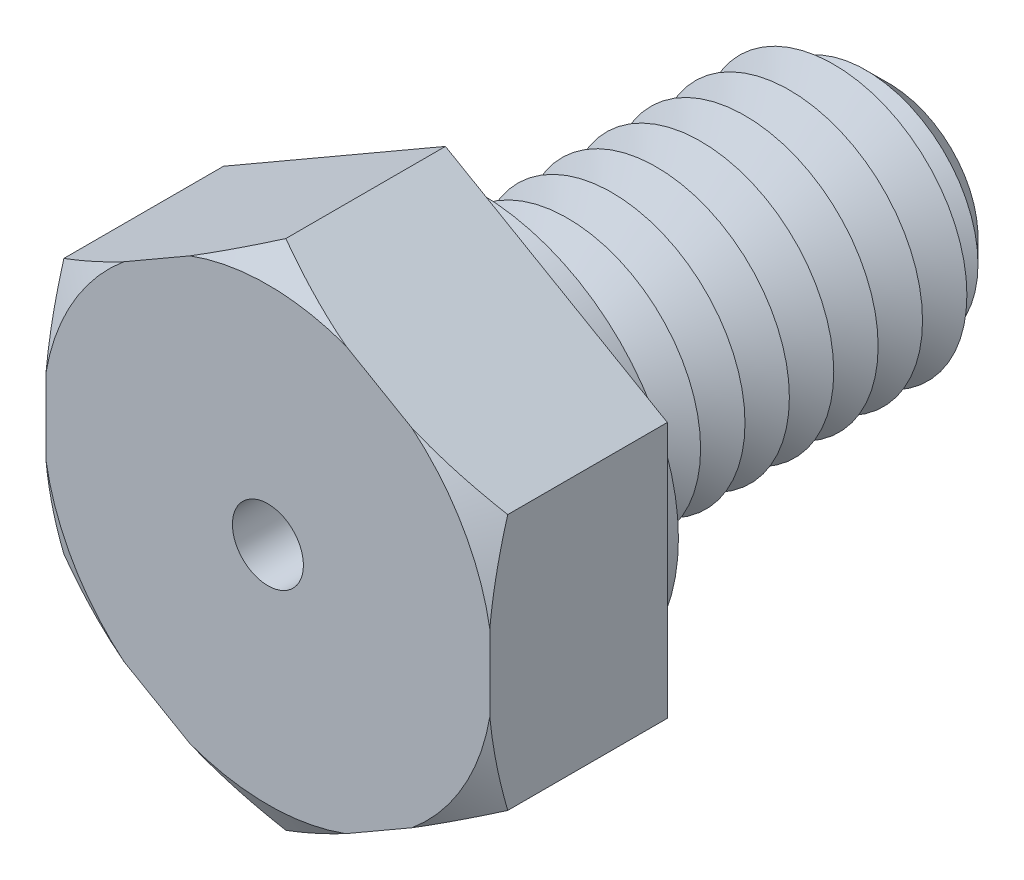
from build123d import *

# Parameters (mm, degrees)
BOSS_EXTRUDE1_DEPTH = 4
SKETCH3_R           = 3
BOSS_EXTRUDE2_DEPTH = 10
SKETCH4_R           = 4.5
BOSS_EXTRUDE3_DEPTH = 0.75
CHAMFER1_SIZE       = 1
LPATTERN1_COUNT     = 9
LPATTERN1_PITCH     = 1
SKETCH8_R           = 0.8
CUT_EXTRUDE1_DEPTH  = 14


with BuildPart() as part:
    # Sketch2 → Boss-Extrude1 (new body)
    with BuildSketch(Plane.XY):
        Polygon((0, 5.773502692), (-5, 2.886751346), (-5, -2.886751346), (0, -5.773502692), (5, -2.886751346), (5, 2.886751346), align=None)
    extrude(amount=BOSS_EXTRUDE1_DEPTH)

    # Sketch3 → Boss-Extrude2 (add)
    with BuildSketch(Plane(origin=(0, 0, 0), x_dir=(-1, 0, 0), z_dir=(0, 0, -1))):
        Circle(SKETCH3_R)
    extrude(amount=BOSS_EXTRUDE2_DEPTH)

    # Sketch4 → Boss-Extrude3 (add)
    with BuildSketch(Plane(origin=(0, 0, 0), x_dir=(-1, 0, 0), z_dir=(0, 0, -1))):
        with Locations(Location((0, 0, 0), (0, 0, 180))):
            Circle(SKETCH4_R)
    extrude(amount=BOSS_EXTRUDE3_DEPTH)

    # Chamfer1
    chamfer1_edges = [part.edges().sort_by_distance(p)[0] for p in [
        (3, 0, -10),
    ]]
    chamfer(chamfer1_edges, length=CHAMFER1_SIZE)

    # Sketch6 → Cut-Revolve1 (revolve, cut)
    with BuildSketch(Plane(origin=(0, 0, 0), x_dir=(0, 0, -1), z_dir=(1, 0, 0)), mode=Mode.PRIVATE) as cut_revolve1_sk:
        Polygon((0.75, 3), (1.25, 2.133974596), (1.75, 3), align=None)
    cut_revolve1 = revolve(cut_revolve1_sk.sketch.rotate(Axis((0, 0, 3.211670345), (0, 0, -1)), 90), axis=Axis((0, 0, 3.211670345), (0, 0, -1)), mode=Mode.SUBTRACT)

    # LPattern1: Cut-Revolve1 ×9
    with Locations(*[(0, 0, -i * LPATTERN1_PITCH) for i in range(1, LPATTERN1_COUNT)]):
        add(cut_revolve1, mode=Mode.SUBTRACT)

    # Sketch7 → Cut-Revolve2 (revolve, cut)
    with BuildSketch(Plane(origin=(0, 0, 0), x_dir=(0, 0, -1), z_dir=(1, 0, 0)), mode=Mode.PRIVATE) as cut_revolve2_sk:
        Polygon((-4, 5.773502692), (-4, 5.073502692), (-3.595854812, 5.773502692), align=None)
    revolve(cut_revolve2_sk.sketch.rotate(Axis((0, 0, 3.211670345), (0, 0, -1)), 270), axis=Axis((0, 0, 3.211670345), (0, 0, -1)), mode=Mode.SUBTRACT)

    # Sketch8 → Cut-Extrude1 (cut)
    with BuildSketch(Plane.XY.offset(4)):
        Circle(SKETCH8_R)
    extrude(amount=-CUT_EXTRUDE1_DEPTH, mode=Mode.SUBTRACT)


solid = part.part
